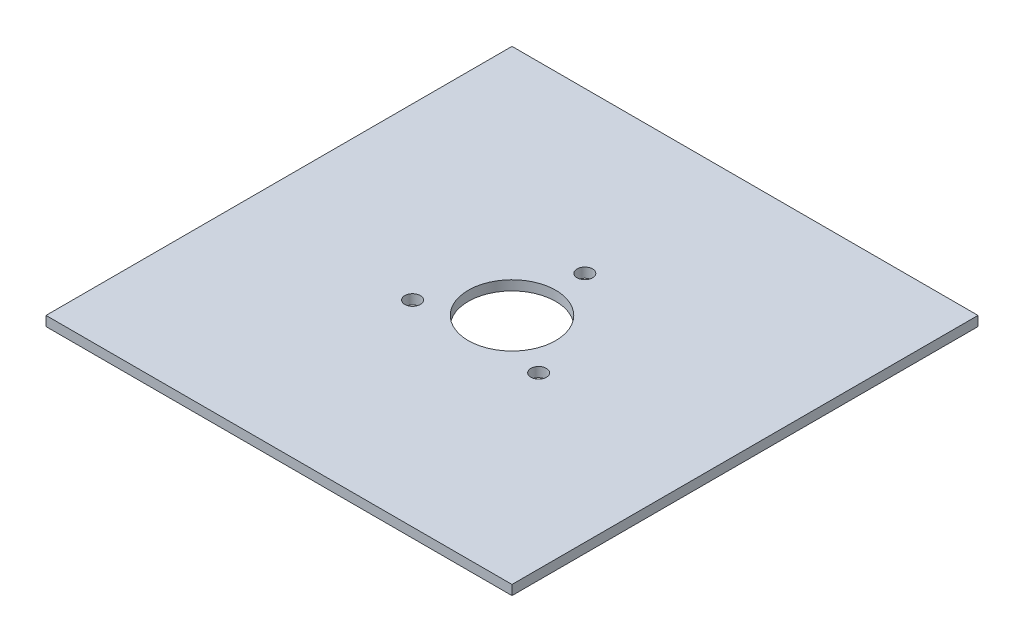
from build123d import *

# Parameters (mm, degrees)
SKETCH1_W           = 152.4
SKETCH1_H           = 152.4
BOSS_EXTRUDE1_DEPTH = 1.5875
SKETCH2_R           = 14.2875
SKETCH2_R_2         = 2.54
CUT_EXTRUDE1_DEPTH  = 108.809835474


with BuildPart() as part:
    # Sketch1 → Boss-Extrude1 (new, symmetric)
    with BuildSketch(Plane(origin=(0, 0, 0), x_dir=(1, 0, 0), z_dir=(0, 1, 0))):
        Rectangle(SKETCH1_W, SKETCH1_H)
    extrude(amount=BOSS_EXTRUDE1_DEPTH, both=True)

    # Sketch2 → Cut-Extrude1 (cut, through all)
    with BuildSketch(Plane(origin=(0, 1.5875, 0), x_dir=(1, 0, 0), z_dir=(0, 1, 0))):
        with Locations(Location((0, 0, 0), (0, 0, 270))):
            Circle(SKETCH2_R)
        with Locations(Location((0, 23.8125, 0), (0, 0, 270))):
            Circle(SKETCH2_R_2)
        with Locations(Location((20.622229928, -11.90625, 0), (0, 0, 270))):
            Circle(SKETCH2_R_2)
        with Locations(Location((-20.622229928, -11.90625, 0), (0, 0, 270))):
            Circle(SKETCH2_R_2)
    extrude(amount=-CUT_EXTRUDE1_DEPTH, mode=Mode.SUBTRACT)


solid = part.part
